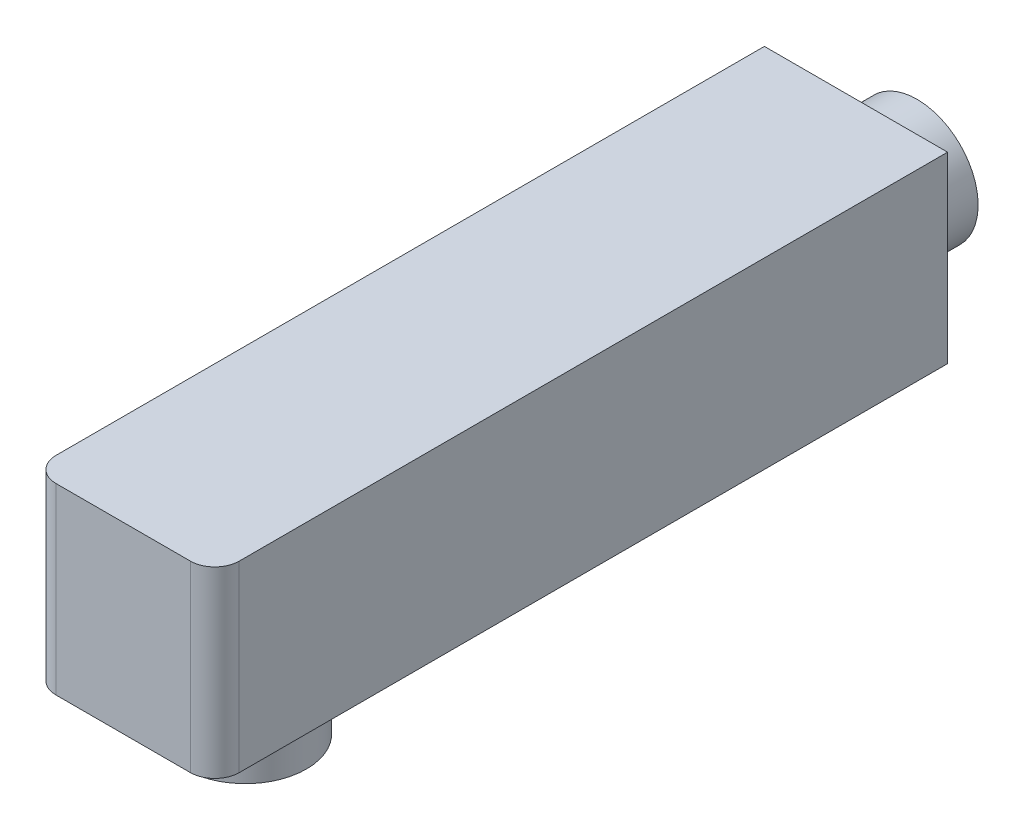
ISO-10303-21;
HEADER;
FILE_DESCRIPTION(('STEP AP214'),'2;1');
FILE_NAME('part.step','',(''),(''),'','','');
FILE_SCHEMA(('AUTOMOTIVE_DESIGN { 1 0 10303 214 1 1 1 1 }'));
ENDSEC;
DATA;
#1=APPLICATION_CONTEXT('core data for automotive mechanical design processes');
#2=APPLICATION_PROTOCOL_DEFINITION('international standard','automotive_design',2000,#1);
#3=PRODUCT_CONTEXT('',#1,'mechanical');
#4=PRODUCT('Part','Part','',(#3));
#5=PRODUCT_RELATED_PRODUCT_CATEGORY('part','',(#4));
#6=PRODUCT_DEFINITION_FORMATION('','',#4);
#7=PRODUCT_DEFINITION_CONTEXT('part definition',#1,'design');
#8=PRODUCT_DEFINITION('design','',#6,#7);
#9=PRODUCT_DEFINITION_SHAPE('','',#8);
#10=(LENGTH_UNIT() NAMED_UNIT(*) SI_UNIT(.MILLI.,.METRE.));
#11=(NAMED_UNIT(*) PLANE_ANGLE_UNIT() SI_UNIT($,.RADIAN.));
#12=(NAMED_UNIT(*) SI_UNIT($,.STERADIAN.) SOLID_ANGLE_UNIT());
#13=UNCERTAINTY_MEASURE_WITH_UNIT(LENGTH_MEASURE(1.E-05),#10,'distance_accuracy_value','');
#14=(GEOMETRIC_REPRESENTATION_CONTEXT(3) GLOBAL_UNCERTAINTY_ASSIGNED_CONTEXT((#13)) GLOBAL_UNIT_ASSIGNED_CONTEXT((#10,
#11,#12)) REPRESENTATION_CONTEXT('',''));
#15=CARTESIAN_POINT('',(0.,0.,0.));
#16=DIRECTION('',(0.,0.,1.));
#17=DIRECTION('',(1.,0.,0.));
#18=AXIS2_PLACEMENT_3D('',#15,#16,#17);
#19=CARTESIAN_POINT('',(0.,0.,600.));
#20=DIRECTION('',(0.,1.,0.));
#21=DIRECTION('',(0.,0.,1.));
#22=AXIS2_PLACEMENT_3D('',#19,#20,#21);
#23=PLANE('',#22);
#24=DIRECTION('',(0.,0.,-1.));
#25=VECTOR('',#24,1.);
#26=CARTESIAN_POINT('',(150.,0.,600.));
#27=LINE('',#26,#25);
#28=CARTESIAN_POINT('',(150.,0.,580.));
#29=VERTEX_POINT('',#28);
#30=CARTESIAN_POINT('',(150.,0.,0.));
#31=VERTEX_POINT('',#30);
#32=EDGE_CURVE('E95',#29,#31,#27,.T.);
#33=ORIENTED_EDGE('',*,*,#32,.F.);
#34=CARTESIAN_POINT('',(130.,0.,580.));
#35=DIRECTION('',(0.,1.,0.));
#36=DIRECTION('',(0.,0.,1.));
#37=AXIS2_PLACEMENT_3D('',#34,#35,#36);
#38=CIRCLE('',#37,20.);
#39=CARTESIAN_POINT('',(130.,0.,600.));
#40=VERTEX_POINT('',#39);
#41=EDGE_CURVE('E43',#29,#40,#38,.F.);
#42=ORIENTED_EDGE('',*,*,#41,.T.);
#43=DIRECTION('',(1.,0.,0.));
#44=VECTOR('',#43,1.);
#45=CARTESIAN_POINT('',(0.,0.,600.));
#46=LINE('',#45,#44);
#47=CARTESIAN_POINT('',(20.,0.,600.));
#48=VERTEX_POINT('',#47);
#49=EDGE_CURVE('E122',#48,#40,#46,.T.);
#50=ORIENTED_EDGE('',*,*,#49,.F.);
#51=CARTESIAN_POINT('',(20.,0.,580.));
#52=DIRECTION('',(0.,1.,0.));
#53=DIRECTION('',(0.,0.,1.));
#54=AXIS2_PLACEMENT_3D('',#51,#52,#53);
#55=CIRCLE('',#54,20.);
#56=CARTESIAN_POINT('',(0.,0.,580.));
#57=VERTEX_POINT('',#56);
#58=EDGE_CURVE('E50',#48,#57,#55,.F.);
#59=ORIENTED_EDGE('',*,*,#58,.T.);
#60=DIRECTION('',(0.,0.,-1.));
#61=VECTOR('',#60,1.);
#62=CARTESIAN_POINT('',(0.,0.,600.));
#63=LINE('',#62,#61);
#64=CARTESIAN_POINT('',(0.,0.,0.));
#65=VERTEX_POINT('',#64);
#66=EDGE_CURVE('E86',#57,#65,#63,.T.);
#67=ORIENTED_EDGE('',*,*,#66,.T.);
#68=DIRECTION('',(1.,0.,0.));
#69=VECTOR('',#68,1.);
#70=CARTESIAN_POINT('',(0.,0.,0.));
#71=LINE('',#70,#69);
#72=EDGE_CURVE('E89',#65,#31,#71,.T.);
#73=ORIENTED_EDGE('',*,*,#72,.T.);
#74=EDGE_LOOP('',(#33,#42,#50,#59,#67,#73));
#75=FACE_BOUND('',#74,.T.);
#76=CARTESIAN_POINT('',(75.,0.,500.));
#77=DIRECTION('',(0.,1.,0.));
#78=DIRECTION('',(0.,0.,1.));
#79=AXIS2_PLACEMENT_3D('',#76,#77,#78);
#80=CIRCLE('',#79,50.);
#81=CARTESIAN_POINT('',(75.,0.,550.));
#82=VERTEX_POINT('',#81);
#83=EDGE_CURVE('E94',#82,#82,#80,.F.);
#84=ORIENTED_EDGE('',*,*,#83,.F.);
#85=EDGE_LOOP('',(#84));
#86=FACE_BOUND('',#85,.T.);
#87=ADVANCED_FACE('F35',(#75,#86),#23,.F.);
#88=CARTESIAN_POINT('',(0.,150.,0.));
#89=DIRECTION('',(0.,0.,-1.));
#90=DIRECTION('',(-1.,0.,0.));
#91=AXIS2_PLACEMENT_3D('',#88,#89,#90);
#92=PLANE('',#91);
#93=DIRECTION('',(0.,-1.,0.));
#94=VECTOR('',#93,1.);
#95=CARTESIAN_POINT('',(0.,0.,0.));
#96=LINE('',#95,#94);
#97=CARTESIAN_POINT('',(0.,150.,0.));
#98=VERTEX_POINT('',#97);
#99=EDGE_CURVE('E102',#98,#65,#96,.T.);
#100=ORIENTED_EDGE('',*,*,#99,.F.);
#101=DIRECTION('',(-1.,0.,0.));
#102=VECTOR('',#101,1.);
#103=CARTESIAN_POINT('',(0.,150.,0.));
#104=LINE('',#103,#102);
#105=CARTESIAN_POINT('',(150.,150.,0.));
#106=VERTEX_POINT('',#105);
#107=EDGE_CURVE('E120',#106,#98,#104,.T.);
#108=ORIENTED_EDGE('',*,*,#107,.F.);
#109=DIRECTION('',(0.,1.,0.));
#110=VECTOR('',#109,1.);
#111=CARTESIAN_POINT('',(150.,0.,0.));
#112=LINE('',#111,#110);
#113=EDGE_CURVE('E104',#31,#106,#112,.T.);
#114=ORIENTED_EDGE('',*,*,#113,.F.);
#115=ORIENTED_EDGE('',*,*,#72,.F.);
#116=EDGE_LOOP('',(#100,#108,#114,#115));
#117=FACE_BOUND('',#116,.T.);
#118=CARTESIAN_POINT('',(75.,75.,0.));
#119=DIRECTION('',(0.,0.,-1.));
#120=DIRECTION('',(-1.,0.,0.));
#121=AXIS2_PLACEMENT_3D('',#118,#119,#120);
#122=CIRCLE('',#121,50.);
#123=CARTESIAN_POINT('',(25.,75.,0.));
#124=VERTEX_POINT('',#123);
#125=EDGE_CURVE('E113',#124,#124,#122,.T.);
#126=ORIENTED_EDGE('',*,*,#125,.F.);
#127=EDGE_LOOP('',(#126));
#128=FACE_BOUND('',#127,.T.);
#129=ADVANCED_FACE('F99',(#117,#128),#92,.T.);
#130=CARTESIAN_POINT('',(0.,0.,600.));
#131=DIRECTION('',(1.,0.,0.));
#132=DIRECTION('',(0.,0.,-1.));
#133=AXIS2_PLACEMENT_3D('',#130,#131,#132);
#134=PLANE('',#133);
#135=ORIENTED_EDGE('',*,*,#66,.F.);
#136=DIRECTION('',(0.,-1.,0.));
#137=VECTOR('',#136,1.);
#138=CARTESIAN_POINT('',(0.,0.,580.));
#139=LINE('',#138,#137);
#140=CARTESIAN_POINT('',(0.,150.,580.));
#141=VERTEX_POINT('',#140);
#142=EDGE_CURVE('E11',#57,#141,#139,.F.);
#143=ORIENTED_EDGE('',*,*,#142,.T.);
#144=DIRECTION('',(0.,0.,-1.));
#145=VECTOR('',#144,1.);
#146=CARTESIAN_POINT('',(0.,150.,600.));
#147=LINE('',#146,#145);
#148=EDGE_CURVE('E108',#141,#98,#147,.T.);
#149=ORIENTED_EDGE('',*,*,#148,.T.);
#150=ORIENTED_EDGE('',*,*,#99,.T.);
#151=EDGE_LOOP('',(#135,#143,#149,#150));
#152=FACE_BOUND('',#151,.T.);
#153=ADVANCED_FACE('F106',(#152),#134,.F.);
#154=CARTESIAN_POINT('',(150.,0.,600.));
#155=DIRECTION('',(-1.,0.,0.));
#156=DIRECTION('',(0.,0.,1.));
#157=AXIS2_PLACEMENT_3D('',#154,#155,#156);
#158=PLANE('',#157);
#159=DIRECTION('',(0.,0.,-1.));
#160=VECTOR('',#159,1.);
#161=CARTESIAN_POINT('',(150.,150.,600.));
#162=LINE('',#161,#160);
#163=CARTESIAN_POINT('',(150.,150.,580.));
#164=VERTEX_POINT('',#163);
#165=EDGE_CURVE('E124',#164,#106,#162,.T.);
#166=ORIENTED_EDGE('',*,*,#165,.F.);
#167=DIRECTION('',(0.,1.,0.));
#168=VECTOR('',#167,1.);
#169=CARTESIAN_POINT('',(150.,0.,580.));
#170=LINE('',#169,#168);
#171=EDGE_CURVE('E58',#164,#29,#170,.F.);
#172=ORIENTED_EDGE('',*,*,#171,.T.);
#173=ORIENTED_EDGE('',*,*,#32,.T.);
#174=ORIENTED_EDGE('',*,*,#113,.T.);
#175=EDGE_LOOP('',(#166,#172,#173,#174));
#176=FACE_BOUND('',#175,.T.);
#177=ADVANCED_FACE('F152',(#176),#158,.F.);
#178=CARTESIAN_POINT('',(0.,150.,600.));
#179=DIRECTION('',(0.,-1.,0.));
#180=DIRECTION('',(0.,0.,-1.));
#181=AXIS2_PLACEMENT_3D('',#178,#179,#180);
#182=PLANE('',#181);
#183=DIRECTION('',(-1.,0.,0.));
#184=VECTOR('',#183,1.);
#185=CARTESIAN_POINT('',(0.,150.,600.));
#186=LINE('',#185,#184);
#187=CARTESIAN_POINT('',(130.,150.,600.));
#188=VERTEX_POINT('',#187);
#189=CARTESIAN_POINT('',(20.,150.,600.));
#190=VERTEX_POINT('',#189);
#191=EDGE_CURVE('E116',#188,#190,#186,.T.);
#192=ORIENTED_EDGE('',*,*,#191,.F.);
#193=CARTESIAN_POINT('',(130.,150.,580.));
#194=DIRECTION('',(0.,-1.,0.));
#195=DIRECTION('',(0.,0.,-1.));
#196=AXIS2_PLACEMENT_3D('',#193,#194,#195);
#197=CIRCLE('',#196,20.);
#198=EDGE_CURVE('E137',#188,#164,#197,.F.);
#199=ORIENTED_EDGE('',*,*,#198,.T.);
#200=ORIENTED_EDGE('',*,*,#165,.T.);
#201=ORIENTED_EDGE('',*,*,#107,.T.);
#202=ORIENTED_EDGE('',*,*,#148,.F.);
#203=CARTESIAN_POINT('',(20.,150.,580.));
#204=DIRECTION('',(0.,-1.,0.));
#205=DIRECTION('',(0.,0.,-1.));
#206=AXIS2_PLACEMENT_3D('',#203,#204,#205);
#207=CIRCLE('',#206,20.);
#208=EDGE_CURVE('E135',#141,#190,#207,.F.);
#209=ORIENTED_EDGE('',*,*,#208,.T.);
#210=EDGE_LOOP('',(#192,#199,#200,#201,#202,#209));
#211=FACE_BOUND('',#210,.T.);
#212=ADVANCED_FACE('F151',(#211),#182,.F.);
#213=CARTESIAN_POINT('',(0.,150.,600.));
#214=DIRECTION('',(0.,0.,-1.));
#215=DIRECTION('',(-1.,0.,0.));
#216=AXIS2_PLACEMENT_3D('',#213,#214,#215);
#217=PLANE('',#216);
#218=ORIENTED_EDGE('',*,*,#49,.T.);
#219=DIRECTION('',(0.,1.,0.));
#220=VECTOR('',#219,1.);
#221=CARTESIAN_POINT('',(130.,150.,600.));
#222=LINE('',#221,#220);
#223=EDGE_CURVE('E132',#40,#188,#222,.T.);
#224=ORIENTED_EDGE('',*,*,#223,.T.);
#225=ORIENTED_EDGE('',*,*,#191,.T.);
#226=DIRECTION('',(0.,-1.,0.));
#227=VECTOR('',#226,1.);
#228=CARTESIAN_POINT('',(20.,150.,600.));
#229=LINE('',#228,#227);
#230=EDGE_CURVE('E129',#190,#48,#229,.T.);
#231=ORIENTED_EDGE('',*,*,#230,.T.);
#232=EDGE_LOOP('',(#218,#224,#225,#231));
#233=FACE_BOUND('',#232,.T.);
#234=ADVANCED_FACE('F145',(#233),#217,.F.);
#235=CARTESIAN_POINT('',(75.,75.,-50.));
#236=DIRECTION('',(0.,0.,1.));
#237=DIRECTION('',(1.,0.,0.));
#238=AXIS2_PLACEMENT_3D('',#235,#236,#237);
#239=CYLINDRICAL_SURFACE('',#238,50.);
#240=CARTESIAN_POINT('',(75.,75.,-50.));
#241=DIRECTION('',(0.,0.,-1.));
#242=DIRECTION('',(-1.,0.,0.));
#243=AXIS2_PLACEMENT_3D('',#240,#241,#242);
#244=CIRCLE('',#243,50.);
#245=CARTESIAN_POINT('',(25.,75.,-50.));
#246=VERTEX_POINT('',#245);
#247=EDGE_CURVE('E110',#246,#246,#244,.T.);
#248=ORIENTED_EDGE('',*,*,#247,.F.);
#249=EDGE_LOOP('',(#248));
#250=FACE_BOUND('',#249,.T.);
#251=ORIENTED_EDGE('',*,*,#125,.T.);
#252=EDGE_LOOP('',(#251));
#253=FACE_BOUND('',#252,.T.);
#254=ADVANCED_FACE('F179',(#250,#253),#239,.T.);
#255=CARTESIAN_POINT('',(75.,75.,-50.));
#256=DIRECTION('',(0.,0.,-1.));
#257=DIRECTION('',(-1.,0.,0.));
#258=AXIS2_PLACEMENT_3D('',#255,#256,#257);
#259=PLANE('',#258);
#260=ORIENTED_EDGE('',*,*,#247,.T.);
#261=EDGE_LOOP('',(#260));
#262=FACE_BOUND('',#261,.T.);
#263=ADVANCED_FACE('F184',(#262),#259,.T.);
#264=CARTESIAN_POINT('',(75.,-50.,500.));
#265=DIRECTION('',(0.,1.,0.));
#266=DIRECTION('',(0.,0.,1.));
#267=AXIS2_PLACEMENT_3D('',#264,#265,#266);
#268=CYLINDRICAL_SURFACE('',#267,50.);
#269=CARTESIAN_POINT('',(75.,-50.,500.));
#270=DIRECTION('',(0.,-1.,0.));
#271=DIRECTION('',(0.,0.,-1.));
#272=AXIS2_PLACEMENT_3D('',#269,#270,#271);
#273=CIRCLE('',#272,50.);
#274=CARTESIAN_POINT('',(75.,-50.,450.));
#275=VERTEX_POINT('',#274);
#276=EDGE_CURVE('E199',#275,#275,#273,.T.);
#277=ORIENTED_EDGE('',*,*,#276,.F.);
#278=EDGE_LOOP('',(#277));
#279=FACE_BOUND('',#278,.T.);
#280=ORIENTED_EDGE('',*,*,#83,.T.);
#281=EDGE_LOOP('',(#280));
#282=FACE_BOUND('',#281,.T.);
#283=ADVANCED_FACE('F188',(#279,#282),#268,.T.);
#284=CARTESIAN_POINT('',(75.,-50.,500.));
#285=DIRECTION('',(0.,-1.,0.));
#286=DIRECTION('',(0.,0.,-1.));
#287=AXIS2_PLACEMENT_3D('',#284,#285,#286);
#288=PLANE('',#287);
#289=ORIENTED_EDGE('',*,*,#276,.T.);
#290=EDGE_LOOP('',(#289));
#291=FACE_BOUND('',#290,.T.);
#292=ADVANCED_FACE('F159',(#291),#288,.T.);
#293=CARTESIAN_POINT('',(130.,150.,580.));
#294=DIRECTION('',(0.,1.,0.));
#295=DIRECTION('',(0.,0.,1.));
#296=AXIS2_PLACEMENT_3D('',#293,#294,#295);
#297=CYLINDRICAL_SURFACE('',#296,20.);
#298=ORIENTED_EDGE('',*,*,#41,.F.);
#299=ORIENTED_EDGE('',*,*,#171,.F.);
#300=ORIENTED_EDGE('',*,*,#198,.F.);
#301=ORIENTED_EDGE('',*,*,#223,.F.);
#302=EDGE_LOOP('',(#298,#299,#300,#301));
#303=FACE_BOUND('',#302,.T.);
#304=ADVANCED_FACE('F149',(#303),#297,.T.);
#305=CARTESIAN_POINT('',(20.,150.,580.));
#306=DIRECTION('',(0.,-1.,0.));
#307=DIRECTION('',(0.,0.,-1.));
#308=AXIS2_PLACEMENT_3D('',#305,#306,#307);
#309=CYLINDRICAL_SURFACE('',#308,20.);
#310=ORIENTED_EDGE('',*,*,#208,.F.);
#311=ORIENTED_EDGE('',*,*,#142,.F.);
#312=ORIENTED_EDGE('',*,*,#58,.F.);
#313=ORIENTED_EDGE('',*,*,#230,.F.);
#314=EDGE_LOOP('',(#310,#311,#312,#313));
#315=FACE_BOUND('',#314,.T.);
#316=ADVANCED_FACE('F37',(#315),#309,.T.);
#317=CLOSED_SHELL('',(#87,#129,#153,#177,#212,#234,#254,#263,#283,#292,#304,#316));
#318=MANIFOLD_SOLID_BREP('B2',#317);
#319=ADVANCED_BREP_SHAPE_REPRESENTATION('',(#18,#318),#14);
#320=SHAPE_DEFINITION_REPRESENTATION(#9,#319);
ENDSEC;
END-ISO-10303-21;
